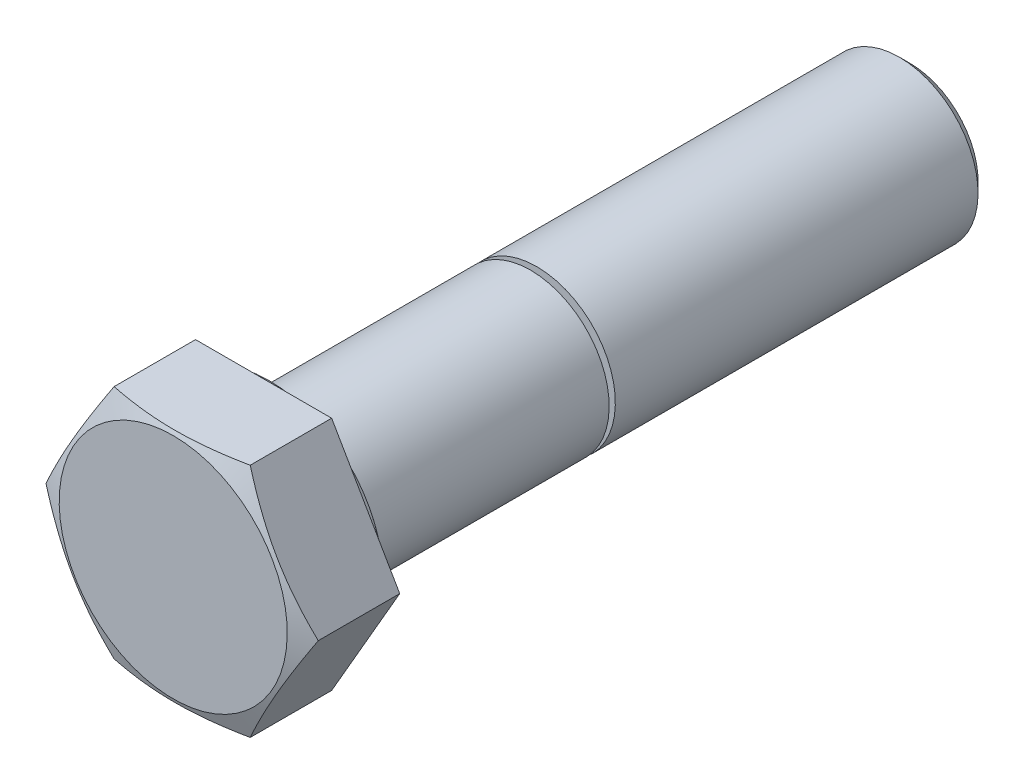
ISO-10303-21;
HEADER;
FILE_DESCRIPTION(('STEP AP214'),'2;1');
FILE_NAME('part.step','',(''),(''),'','','');
FILE_SCHEMA(('AUTOMOTIVE_DESIGN { 1 0 10303 214 1 1 1 1 }'));
ENDSEC;
DATA;
#1=APPLICATION_CONTEXT('core data for automotive mechanical design processes');
#2=APPLICATION_PROTOCOL_DEFINITION('international standard','automotive_design',2000,#1);
#3=PRODUCT_CONTEXT('',#1,'mechanical');
#4=PRODUCT('Part','Part','',(#3));
#5=PRODUCT_RELATED_PRODUCT_CATEGORY('part','',(#4));
#6=PRODUCT_DEFINITION_FORMATION('','',#4);
#7=PRODUCT_DEFINITION_CONTEXT('part definition',#1,'design');
#8=PRODUCT_DEFINITION('design','',#6,#7);
#9=PRODUCT_DEFINITION_SHAPE('','',#8);
#10=(LENGTH_UNIT() NAMED_UNIT(*) SI_UNIT(.MILLI.,.METRE.));
#11=(NAMED_UNIT(*) PLANE_ANGLE_UNIT() SI_UNIT($,.RADIAN.));
#12=(NAMED_UNIT(*) SI_UNIT($,.STERADIAN.) SOLID_ANGLE_UNIT());
#13=UNCERTAINTY_MEASURE_WITH_UNIT(LENGTH_MEASURE(1.E-05),#10,'distance_accuracy_value','');
#14=(GEOMETRIC_REPRESENTATION_CONTEXT(3) GLOBAL_UNCERTAINTY_ASSIGNED_CONTEXT((#13)) GLOBAL_UNIT_ASSIGNED_CONTEXT((#10,
#11,#12)) REPRESENTATION_CONTEXT('',''));
#15=CARTESIAN_POINT('',(0.,0.,0.));
#16=DIRECTION('',(0.,0.,1.));
#17=DIRECTION('',(1.,0.,0.));
#18=AXIS2_PLACEMENT_3D('',#15,#16,#17);
#19=CARTESIAN_POINT('',(0.,3.45875,-65.));
#20=DIRECTION('',(0.,0.,-1.));
#21=DIRECTION('',(0.,1.,0.));
#22=AXIS2_PLACEMENT_3D('',#19,#20,#21);
#23=PLANE('',#22);
#24=CARTESIAN_POINT('',(0.,0.,-65.));
#25=DIRECTION('',(0.,0.,-1.));
#26=DIRECTION('',(0.,1.,0.));
#27=AXIS2_PLACEMENT_3D('',#24,#25,#26);
#28=CIRCLE('',#27,6.9175);
#29=CARTESIAN_POINT('',(0.,6.9175,-65.));
#30=VERTEX_POINT('',#29);
#31=EDGE_CURVE('E11',#30,#30,#28,.T.);
#32=ORIENTED_EDGE('',*,*,#31,.T.);
#33=EDGE_LOOP('',(#32));
#34=FACE_BOUND('',#33,.T.);
#35=ADVANCED_FACE('F16',(#34),#23,.T.);
#36=CARTESIAN_POINT('',(0.,0.,-64.45875));
#37=DIRECTION('',(0.,0.,1.));
#38=DIRECTION('',(0.,1.,0.));
#39=AXIS2_PLACEMENT_3D('',#36,#37,#38);
#40=CONICAL_SURFACE('',#39,7.45875,0.785398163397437);
#41=CARTESIAN_POINT('',(0.,0.,-63.9175));
#42=DIRECTION('',(0.,0.,-1.));
#43=DIRECTION('',(0.,1.,0.));
#44=AXIS2_PLACEMENT_3D('',#41,#42,#43);
#45=CIRCLE('',#44,8.);
#46=CARTESIAN_POINT('',(0.,8.,-63.9175));
#47=VERTEX_POINT('',#46);
#48=EDGE_CURVE('E28',#47,#47,#45,.T.);
#49=ORIENTED_EDGE('',*,*,#48,.T.);
#50=EDGE_LOOP('',(#49));
#51=FACE_BOUND('',#50,.T.);
#52=ORIENTED_EDGE('',*,*,#31,.F.);
#53=EDGE_LOOP('',(#52));
#54=FACE_BOUND('',#53,.T.);
#55=ADVANCED_FACE('F224',(#51,#54),#40,.T.);
#56=CARTESIAN_POINT('',(0.,0.,-45.45875));
#57=DIRECTION('',(0.,0.,1.));
#58=DIRECTION('',(0.,1.,0.));
#59=AXIS2_PLACEMENT_3D('',#56,#57,#58);
#60=CYLINDRICAL_SURFACE('',#59,8.);
#61=CARTESIAN_POINT('',(0.,0.,-27.));
#62=DIRECTION('',(0.,0.,-1.));
#63=DIRECTION('',(0.,1.,0.));
#64=AXIS2_PLACEMENT_3D('',#61,#62,#63);
#65=CIRCLE('',#64,8.);
#66=CARTESIAN_POINT('',(0.,8.,-27.));
#67=VERTEX_POINT('',#66);
#68=EDGE_CURVE('E76',#67,#67,#65,.T.);
#69=ORIENTED_EDGE('',*,*,#68,.T.);
#70=EDGE_LOOP('',(#69));
#71=FACE_BOUND('',#70,.T.);
#72=ORIENTED_EDGE('',*,*,#48,.F.);
#73=EDGE_LOOP('',(#72));
#74=FACE_BOUND('',#73,.T.);
#75=ADVANCED_FACE('F77',(#71,#74),#60,.T.);
#76=CARTESIAN_POINT('',(0.,7.45875,-27.));
#77=DIRECTION('',(0.,0.,1.));
#78=DIRECTION('',(0.,-1.,0.));
#79=AXIS2_PLACEMENT_3D('',#76,#77,#78);
#80=PLANE('',#79);
#81=CARTESIAN_POINT('',(0.,0.,-27.));
#82=DIRECTION('',(0.,0.,-1.));
#83=DIRECTION('',(0.,1.,0.));
#84=AXIS2_PLACEMENT_3D('',#81,#82,#83);
#85=CIRCLE('',#84,6.9175);
#86=CARTESIAN_POINT('',(0.,6.9175,-27.));
#87=VERTEX_POINT('',#86);
#88=EDGE_CURVE('E80',#87,#87,#85,.T.);
#89=ORIENTED_EDGE('',*,*,#88,.T.);
#90=EDGE_LOOP('',(#89));
#91=FACE_BOUND('',#90,.T.);
#92=ORIENTED_EDGE('',*,*,#68,.F.);
#93=EDGE_LOOP('',(#92));
#94=FACE_BOUND('',#93,.T.);
#95=ADVANCED_FACE('F269',(#91,#94),#80,.T.);
#96=CARTESIAN_POINT('',(0.,0.,-26.6875091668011));
#97=DIRECTION('',(0.,0.,1.));
#98=DIRECTION('',(0.,1.,0.));
#99=AXIS2_PLACEMENT_3D('',#96,#97,#98);
#100=CONICAL_SURFACE('',#99,7.45875,1.0471975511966);
#101=CARTESIAN_POINT('',(0.,0.,-26.3750183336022));
#102=DIRECTION('',(0.,0.,-1.));
#103=DIRECTION('',(0.,1.,0.));
#104=AXIS2_PLACEMENT_3D('',#101,#102,#103);
#105=CIRCLE('',#104,8.);
#106=CARTESIAN_POINT('',(0.,8.,-26.3750183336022));
#107=VERTEX_POINT('',#106);
#108=EDGE_CURVE('E83',#107,#107,#105,.T.);
#109=ORIENTED_EDGE('',*,*,#108,.T.);
#110=EDGE_LOOP('',(#109));
#111=FACE_BOUND('',#110,.T.);
#112=ORIENTED_EDGE('',*,*,#88,.F.);
#113=EDGE_LOOP('',(#112));
#114=FACE_BOUND('',#113,.T.);
#115=ADVANCED_FACE('F219',(#111,#114),#100,.T.);
#116=CARTESIAN_POINT('',(0.,0.,-13.5875091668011));
#117=DIRECTION('',(0.,0.,1.));
#118=DIRECTION('',(0.,1.,0.));
#119=AXIS2_PLACEMENT_3D('',#116,#117,#118);
#120=CYLINDRICAL_SURFACE('',#119,8.);
#121=CARTESIAN_POINT('',(0.,0.,-0.8));
#122=DIRECTION('',(0.,0.,-1.));
#123=DIRECTION('',(0.,1.,0.));
#124=AXIS2_PLACEMENT_3D('',#121,#122,#123);
#125=CIRCLE('',#124,8.);
#126=CARTESIAN_POINT('',(0.,8.,-0.8));
#127=VERTEX_POINT('',#126);
#128=EDGE_CURVE('E125',#127,#127,#125,.T.);
#129=ORIENTED_EDGE('',*,*,#128,.T.);
#130=EDGE_LOOP('',(#129));
#131=FACE_BOUND('',#130,.T.);
#132=ORIENTED_EDGE('',*,*,#108,.F.);
#133=EDGE_LOOP('',(#132));
#134=FACE_BOUND('',#133,.T.);
#135=ADVANCED_FACE('F204',(#131,#134),#120,.T.);
#136=CARTESIAN_POINT('',(0.,0.,-0.8));
#137=DIRECTION('',(0.,0.,-1.));
#138=DIRECTION('',(-1.,0.,0.));
#139=AXIS2_PLACEMENT_3D('',#136,#137,#138);
#140=TOROIDAL_SURFACE('',#139,8.8,0.8);
#141=CARTESIAN_POINT('',(0.,0.,0.));
#142=DIRECTION('',(0.,0.,-1.));
#143=DIRECTION('',(0.,1.,0.));
#144=AXIS2_PLACEMENT_3D('',#141,#142,#143);
#145=CIRCLE('',#144,8.8);
#146=CARTESIAN_POINT('',(0.,8.8,0.));
#147=VERTEX_POINT('',#146);
#148=EDGE_CURVE('E121',#147,#147,#145,.T.);
#149=ORIENTED_EDGE('',*,*,#148,.T.);
#150=EDGE_LOOP('',(#149));
#151=FACE_BOUND('',#150,.T.);
#152=ORIENTED_EDGE('',*,*,#128,.F.);
#153=EDGE_LOOP('',(#152));
#154=FACE_BOUND('',#153,.T.);
#155=ADVANCED_FACE('F207',(#151,#154),#140,.F.);
#156=CARTESIAN_POINT('',(0.,9.9,0.));
#157=DIRECTION('',(0.,0.,-1.));
#158=DIRECTION('',(0.,1.,0.));
#159=AXIS2_PLACEMENT_3D('',#156,#157,#158);
#160=PLANE('',#159);
#161=CARTESIAN_POINT('',(0.,0.,0.));
#162=DIRECTION('',(0.,0.,-1.));
#163=DIRECTION('',(0.,1.,0.));
#164=AXIS2_PLACEMENT_3D('',#161,#162,#163);
#165=CIRCLE('',#164,11.);
#166=CARTESIAN_POINT('',(0.,11.,0.));
#167=VERTEX_POINT('',#166);
#168=EDGE_CURVE('E117',#167,#167,#165,.T.);
#169=ORIENTED_EDGE('',*,*,#168,.T.);
#170=EDGE_LOOP('',(#169));
#171=FACE_BOUND('',#170,.T.);
#172=ORIENTED_EDGE('',*,*,#148,.F.);
#173=EDGE_LOOP('',(#172));
#174=FACE_BOUND('',#173,.T.);
#175=ADVANCED_FACE('F209',(#171,#174),#160,.T.);
#176=CARTESIAN_POINT('',(0.,0.,0.8));
#177=DIRECTION('',(0.,0.,-1.));
#178=DIRECTION('',(-1.,0.,0.));
#179=AXIS2_PLACEMENT_3D('',#176,#177,#178);
#180=TOROIDAL_SURFACE('',#179,11.,0.8);
#181=CARTESIAN_POINT('',(0.,0.,0.8));
#182=DIRECTION('',(0.,0.,-1.));
#183=DIRECTION('',(0.,1.,0.));
#184=AXIS2_PLACEMENT_3D('',#181,#182,#183);
#185=CIRCLE('',#184,11.8);
#186=CARTESIAN_POINT('',(0.,11.8,0.8));
#187=VERTEX_POINT('',#186);
#188=EDGE_CURVE('E103',#187,#187,#185,.T.);
#189=ORIENTED_EDGE('',*,*,#188,.T.);
#190=EDGE_LOOP('',(#189));
#191=FACE_BOUND('',#190,.T.);
#192=ORIENTED_EDGE('',*,*,#168,.F.);
#193=EDGE_LOOP('',(#192));
#194=FACE_BOUND('',#193,.T.);
#195=ADVANCED_FACE('F217',(#191,#194),#180,.T.);
#196=CARTESIAN_POINT('',(0.,12.8282,0.8));
#197=DIRECTION('',(0.,0.,-1.));
#198=DIRECTION('',(0.,1.,0.));
#199=AXIS2_PLACEMENT_3D('',#196,#197,#198);
#200=PLANE('',#199);
#201=ORIENTED_EDGE('',*,*,#188,.F.);
#202=EDGE_LOOP('',(#201));
#203=FACE_BOUND('',#202,.T.);
#204=DIRECTION('',(0.5,-0.866025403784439,0.));
#205=VECTOR('',#204,1.);
#206=CARTESIAN_POINT('',(-13.1696867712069,-1.18942220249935,0.8));
#207=LINE('',#206,#205);
#208=CARTESIAN_POINT('',(-13.8564,0.,0.8));
#209=VERTEX_POINT('',#208);
#210=CARTESIAN_POINT('',(-6.9282,-11.9999944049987,0.8));
#211=VERTEX_POINT('',#210);
#212=EDGE_CURVE('E94',#209,#211,#207,.T.);
#213=ORIENTED_EDGE('',*,*,#212,.F.);
#214=DIRECTION('',(-0.5,-0.866025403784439,0.));
#215=VECTOR('',#214,1.);
#216=CARTESIAN_POINT('',(-7.61491322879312,10.8105722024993,0.8));
#217=LINE('',#216,#215);
#218=CARTESIAN_POINT('',(-6.9282,11.9999944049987,0.8));
#219=VERTEX_POINT('',#218);
#220=EDGE_CURVE('E98',#219,#209,#217,.T.);
#221=ORIENTED_EDGE('',*,*,#220,.F.);
#222=DIRECTION('',(-1.,0.,0.));
#223=VECTOR('',#222,1.);
#224=CARTESIAN_POINT('',(0.,11.9999944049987,0.8));
#225=LINE('',#224,#223);
#226=CARTESIAN_POINT('',(6.9282,11.9999944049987,0.8));
#227=VERTEX_POINT('',#226);
#228=EDGE_CURVE('E144',#227,#219,#225,.T.);
#229=ORIENTED_EDGE('',*,*,#228,.F.);
#230=DIRECTION('',(-0.5,0.866025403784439,0.));
#231=VECTOR('',#230,1.);
#232=CARTESIAN_POINT('',(7.61491322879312,10.8105722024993,0.8));
#233=LINE('',#232,#231);
#234=CARTESIAN_POINT('',(13.8564,0.,0.8));
#235=VERTEX_POINT('',#234);
#236=EDGE_CURVE('E133',#235,#227,#233,.T.);
#237=ORIENTED_EDGE('',*,*,#236,.F.);
#238=DIRECTION('',(0.5,0.866025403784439,0.));
#239=VECTOR('',#238,1.);
#240=CARTESIAN_POINT('',(13.1696867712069,-1.18942220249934,0.8));
#241=LINE('',#240,#239);
#242=CARTESIAN_POINT('',(6.9282,-11.9999944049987,0.8));
#243=VERTEX_POINT('',#242);
#244=EDGE_CURVE('E89',#243,#235,#241,.T.);
#245=ORIENTED_EDGE('',*,*,#244,.F.);
#246=DIRECTION('',(1.,0.,0.));
#247=VECTOR('',#246,1.);
#248=CARTESIAN_POINT('',(0.,-11.9999944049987,0.8));
#249=LINE('',#248,#247);
#250=EDGE_CURVE('E111',#211,#243,#249,.T.);
#251=ORIENTED_EDGE('',*,*,#250,.F.);
#252=EDGE_LOOP('',(#213,#221,#229,#237,#245,#251));
#253=FACE_BOUND('',#252,.T.);
#254=ADVANCED_FACE('F185',(#203,#253),#200,.T.);
#255=CARTESIAN_POINT('',(0.,0.,9.54545454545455));
#256=DIRECTION('',(0.,0.,-1.));
#257=DIRECTION('',(0.,1.,0.));
#258=AXIS2_PLACEMENT_3D('',#255,#256,#257);
#259=CONICAL_SURFACE('',#258,12.7313605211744,1.18682389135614);
#260=CARTESIAN_POINT('',(0.,0.,10.));
#261=DIRECTION('',(0.,0.,-1.));
#262=DIRECTION('',(0.,1.,0.));
#263=AXIS2_PLACEMENT_3D('',#260,#261,#262);
#264=CIRCLE('',#263,11.6063210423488);
#265=CARTESIAN_POINT('',(0.,11.6063210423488,10.));
#266=VERTEX_POINT('',#265);
#267=EDGE_CURVE('E100',#266,#266,#264,.T.);
#268=ORIENTED_EDGE('',*,*,#267,.T.);
#269=EDGE_LOOP('',(#268));
#270=FACE_BOUND('',#269,.T.);
#271=CARTESIAN_POINT('',(6.9282,-11.9999944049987,9.09090909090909));
#272=CARTESIAN_POINT('',(0.,-11.9999944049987,10.4904963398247));
#273=CARTESIAN_POINT('',(-6.9282,-11.9999944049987,9.09090909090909));
#274=(BOUNDED_CURVE() B_SPLINE_CURVE(2,(#271,#272,#273),.UNSPECIFIED.,.F.,
.F.) B_SPLINE_CURVE_WITH_KNOTS((3,3),(0.,13.9373613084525),
.UNSPECIFIED.) CURVE() GEOMETRIC_REPRESENTATION_ITEM() RATIONAL_B_SPLINE_CURVE((1.,
1.15470053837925,1.)) REPRESENTATION_ITEM(''));
#275=CARTESIAN_POINT('',(6.9282,-11.9999944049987,9.09090909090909));
#276=VERTEX_POINT('',#275);
#277=CARTESIAN_POINT('',(-6.9282,-11.9999944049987,9.09090909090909));
#278=VERTEX_POINT('',#277);
#279=EDGE_CURVE('E129',#276,#278,#274,.T.);
#280=ORIENTED_EDGE('',*,*,#279,.F.);
#281=CARTESIAN_POINT('',(13.8564,0.,9.09090909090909));
#282=CARTESIAN_POINT('',(10.3923,-5.99999720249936,10.4904963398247));
#283=CARTESIAN_POINT('',(6.9282,-11.9999944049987,9.09090909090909));
#284=(BOUNDED_CURVE() B_SPLINE_CURVE(2,(#281,#282,#283),.UNSPECIFIED.,.F.,
.F.) B_SPLINE_CURVE_WITH_KNOTS((3,3),(0.,13.9373613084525),
.UNSPECIFIED.) CURVE() GEOMETRIC_REPRESENTATION_ITEM() RATIONAL_B_SPLINE_CURVE((1.,
1.15470053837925,1.)) REPRESENTATION_ITEM(''));
#285=CARTESIAN_POINT('',(13.8564,0.,9.09090909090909));
#286=VERTEX_POINT('',#285);
#287=EDGE_CURVE('E20',#286,#276,#284,.T.);
#288=ORIENTED_EDGE('',*,*,#287,.F.);
#289=CARTESIAN_POINT('',(6.9282,11.9999944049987,9.09090909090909));
#290=CARTESIAN_POINT('',(10.3923,5.99999720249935,10.4904963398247));
#291=CARTESIAN_POINT('',(13.8564,0.,9.09090909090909));
#292=(BOUNDED_CURVE() B_SPLINE_CURVE(2,(#289,#290,#291),.UNSPECIFIED.,.F.,
.F.) B_SPLINE_CURVE_WITH_KNOTS((3,3),(0.,13.9373613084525),
.UNSPECIFIED.) CURVE() GEOMETRIC_REPRESENTATION_ITEM() RATIONAL_B_SPLINE_CURVE((1.,
1.15470053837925,1.)) REPRESENTATION_ITEM(''));
#293=CARTESIAN_POINT('',(6.9282,11.9999944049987,9.09090909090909));
#294=VERTEX_POINT('',#293);
#295=EDGE_CURVE('E104',#294,#286,#292,.T.);
#296=ORIENTED_EDGE('',*,*,#295,.F.);
#297=CARTESIAN_POINT('',(-6.9282,11.9999944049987,9.09090909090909));
#298=CARTESIAN_POINT('',(0.,11.9999944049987,10.4904963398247));
#299=CARTESIAN_POINT('',(6.9282,11.9999944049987,9.09090909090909));
#300=(BOUNDED_CURVE() B_SPLINE_CURVE(2,(#297,#298,#299),.UNSPECIFIED.,.F.,
.F.) B_SPLINE_CURVE_WITH_KNOTS((3,3),(0.,13.9373613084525),
.UNSPECIFIED.) CURVE() GEOMETRIC_REPRESENTATION_ITEM() RATIONAL_B_SPLINE_CURVE((1.,
1.15470053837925,1.)) REPRESENTATION_ITEM(''));
#301=CARTESIAN_POINT('',(-6.9282,11.9999944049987,9.09090909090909));
#302=VERTEX_POINT('',#301);
#303=EDGE_CURVE('E99',#302,#294,#300,.T.);
#304=ORIENTED_EDGE('',*,*,#303,.F.);
#305=CARTESIAN_POINT('',(-13.8564,0.,9.09090909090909));
#306=CARTESIAN_POINT('',(-10.3923,5.99999720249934,10.4904963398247));
#307=CARTESIAN_POINT('',(-6.9282,11.9999944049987,9.09090909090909));
#308=(BOUNDED_CURVE() B_SPLINE_CURVE(2,(#305,#306,#307),.UNSPECIFIED.,.F.,
.F.) B_SPLINE_CURVE_WITH_KNOTS((3,3),(0.,13.9373613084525),
.UNSPECIFIED.) CURVE() GEOMETRIC_REPRESENTATION_ITEM() RATIONAL_B_SPLINE_CURVE((1.,
1.15470053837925,1.)) REPRESENTATION_ITEM(''));
#309=CARTESIAN_POINT('',(-13.8564,0.,9.09090909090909));
#310=VERTEX_POINT('',#309);
#311=EDGE_CURVE('E105',#310,#302,#308,.T.);
#312=ORIENTED_EDGE('',*,*,#311,.F.);
#313=CARTESIAN_POINT('',(-6.9282,-11.9999944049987,9.09090909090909));
#314=CARTESIAN_POINT('',(-10.3923,-5.99999720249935,10.4904963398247));
#315=CARTESIAN_POINT('',(-13.8564,0.,9.09090909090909));
#316=(BOUNDED_CURVE() B_SPLINE_CURVE(2,(#313,#314,#315),.UNSPECIFIED.,.F.,
.F.) B_SPLINE_CURVE_WITH_KNOTS((3,3),(0.,13.9373613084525),
.UNSPECIFIED.) CURVE() GEOMETRIC_REPRESENTATION_ITEM() RATIONAL_B_SPLINE_CURVE((1.,
1.15470053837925,1.)) REPRESENTATION_ITEM(''));
#317=EDGE_CURVE('E93',#278,#310,#316,.T.);
#318=ORIENTED_EDGE('',*,*,#317,.F.);
#319=EDGE_LOOP('',(#280,#288,#296,#304,#312,#318));
#320=FACE_BOUND('',#319,.T.);
#321=ADVANCED_FACE('F245',(#270,#320),#259,.T.);
#322=CARTESIAN_POINT('',(0.,5.80316052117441,10.));
#323=DIRECTION('',(0.,0.,1.));
#324=DIRECTION('',(0.,-1.,0.));
#325=AXIS2_PLACEMENT_3D('',#322,#323,#324);
#326=PLANE('',#325);
#327=ORIENTED_EDGE('',*,*,#267,.F.);
#328=EDGE_LOOP('',(#327));
#329=FACE_BOUND('',#328,.T.);
#330=ADVANCED_FACE('F244',(#329),#326,.T.);
#331=CARTESIAN_POINT('',(10.3923,5.99999720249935,10.));
#332=DIRECTION('',(0.866025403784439,0.5,0.));
#333=DIRECTION('',(0.5,-0.866025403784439,0.));
#334=AXIS2_PLACEMENT_3D('',#331,#332,#333);
#335=PLANE('',#334);
#336=ORIENTED_EDGE('',*,*,#236,.T.);
#337=DIRECTION('',(0.,0.,1.));
#338=VECTOR('',#337,1.);
#339=CARTESIAN_POINT('',(6.9282,11.9999944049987,4.94545454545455));
#340=LINE('',#339,#338);
#341=EDGE_CURVE('E95',#227,#294,#340,.T.);
#342=ORIENTED_EDGE('',*,*,#341,.T.);
#343=ORIENTED_EDGE('',*,*,#295,.T.);
#344=DIRECTION('',(0.,0.,1.));
#345=VECTOR('',#344,1.);
#346=CARTESIAN_POINT('',(13.8564,0.,4.94545454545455));
#347=LINE('',#346,#345);
#348=EDGE_CURVE('E86',#235,#286,#347,.T.);
#349=ORIENTED_EDGE('',*,*,#348,.F.);
#350=EDGE_LOOP('',(#336,#342,#343,#349));
#351=FACE_BOUND('',#350,.T.);
#352=ADVANCED_FACE('F242',(#351),#335,.T.);
#353=CARTESIAN_POINT('',(10.3923,-5.99999720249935,10.));
#354=DIRECTION('',(0.866025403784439,-0.5,0.));
#355=DIRECTION('',(-0.5,-0.866025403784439,0.));
#356=AXIS2_PLACEMENT_3D('',#353,#354,#355);
#357=PLANE('',#356);
#358=ORIENTED_EDGE('',*,*,#244,.T.);
#359=ORIENTED_EDGE('',*,*,#348,.T.);
#360=ORIENTED_EDGE('',*,*,#287,.T.);
#361=DIRECTION('',(0.,0.,1.));
#362=VECTOR('',#361,1.);
#363=CARTESIAN_POINT('',(6.9282,-11.9999944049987,4.94545454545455));
#364=LINE('',#363,#362);
#365=EDGE_CURVE('E116',#243,#276,#364,.T.);
#366=ORIENTED_EDGE('',*,*,#365,.F.);
#367=EDGE_LOOP('',(#358,#359,#360,#366));
#368=FACE_BOUND('',#367,.T.);
#369=ADVANCED_FACE('F18',(#368),#357,.T.);
#370=CARTESIAN_POINT('',(0.,-11.9999944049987,10.));
#371=DIRECTION('',(0.,-1.,0.));
#372=DIRECTION('',(-1.,0.,0.));
#373=AXIS2_PLACEMENT_3D('',#370,#371,#372);
#374=PLANE('',#373);
#375=ORIENTED_EDGE('',*,*,#250,.T.);
#376=ORIENTED_EDGE('',*,*,#365,.T.);
#377=ORIENTED_EDGE('',*,*,#279,.T.);
#378=DIRECTION('',(0.,0.,1.));
#379=VECTOR('',#378,1.);
#380=CARTESIAN_POINT('',(-6.9282,-11.9999944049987,4.94545454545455));
#381=LINE('',#380,#379);
#382=EDGE_CURVE('E90',#211,#278,#381,.T.);
#383=ORIENTED_EDGE('',*,*,#382,.F.);
#384=EDGE_LOOP('',(#375,#376,#377,#383));
#385=FACE_BOUND('',#384,.T.);
#386=ADVANCED_FACE('F237',(#385),#374,.T.);
#387=CARTESIAN_POINT('',(-10.3923,-5.99999720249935,10.));
#388=DIRECTION('',(-0.866025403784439,-0.5,0.));
#389=DIRECTION('',(-0.5,0.866025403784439,0.));
#390=AXIS2_PLACEMENT_3D('',#387,#388,#389);
#391=PLANE('',#390);
#392=ORIENTED_EDGE('',*,*,#212,.T.);
#393=ORIENTED_EDGE('',*,*,#382,.T.);
#394=ORIENTED_EDGE('',*,*,#317,.T.);
#395=DIRECTION('',(0.,0.,-1.));
#396=VECTOR('',#395,1.);
#397=CARTESIAN_POINT('',(-13.8564,0.,4.94545454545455));
#398=LINE('',#397,#396);
#399=EDGE_CURVE('E110',#310,#209,#398,.T.);
#400=ORIENTED_EDGE('',*,*,#399,.T.);
#401=EDGE_LOOP('',(#392,#393,#394,#400));
#402=FACE_BOUND('',#401,.T.);
#403=ADVANCED_FACE('F175',(#402),#391,.T.);
#404=CARTESIAN_POINT('',(-10.3923,5.99999720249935,10.));
#405=DIRECTION('',(-0.866025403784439,0.5,0.));
#406=DIRECTION('',(0.5,0.866025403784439,0.));
#407=AXIS2_PLACEMENT_3D('',#404,#405,#406);
#408=PLANE('',#407);
#409=ORIENTED_EDGE('',*,*,#220,.T.);
#410=ORIENTED_EDGE('',*,*,#399,.F.);
#411=ORIENTED_EDGE('',*,*,#311,.T.);
#412=DIRECTION('',(0.,0.,1.));
#413=VECTOR('',#412,1.);
#414=CARTESIAN_POINT('',(-6.9282,11.9999944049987,4.94545454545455));
#415=LINE('',#414,#413);
#416=EDGE_CURVE('E150',#219,#302,#415,.T.);
#417=ORIENTED_EDGE('',*,*,#416,.F.);
#418=EDGE_LOOP('',(#409,#410,#411,#417));
#419=FACE_BOUND('',#418,.T.);
#420=ADVANCED_FACE('F181',(#419),#408,.T.);
#421=CARTESIAN_POINT('',(0.,11.9999944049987,10.));
#422=DIRECTION('',(0.,1.,0.));
#423=DIRECTION('',(1.,0.,0.));
#424=AXIS2_PLACEMENT_3D('',#421,#422,#423);
#425=PLANE('',#424);
#426=ORIENTED_EDGE('',*,*,#228,.T.);
#427=ORIENTED_EDGE('',*,*,#416,.T.);
#428=ORIENTED_EDGE('',*,*,#303,.T.);
#429=ORIENTED_EDGE('',*,*,#341,.F.);
#430=EDGE_LOOP('',(#426,#427,#428,#429));
#431=FACE_BOUND('',#430,.T.);
#432=ADVANCED_FACE('F260',(#431),#425,.T.);
#433=CLOSED_SHELL('',(#35,#55,#75,#95,#115,#135,#155,#175,#195,#254,#321,#330,#352,#369,#386,
#403,#420,#432));
#434=MANIFOLD_SOLID_BREP('B1',#433);
#435=ADVANCED_BREP_SHAPE_REPRESENTATION('',(#18,#434),#14);
#436=SHAPE_DEFINITION_REPRESENTATION(#9,#435);
ENDSEC;
END-ISO-10303-21;
